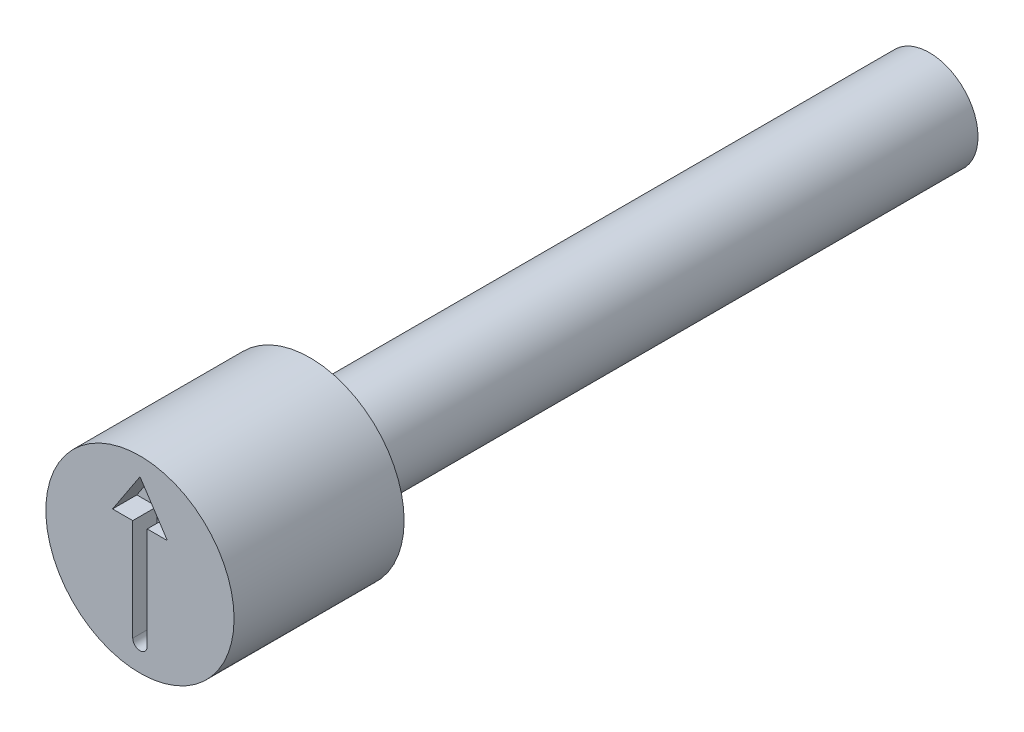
from build123d import *

# Parameters (mm, degrees)
CUT_EXTRUDE4_DEPTH = 0.4


with BuildPart() as part:
    # Sketch2 → Revolve1 (revolve)
    with BuildSketch(Plane(origin=(0, 0, 0), x_dir=(0, 0, -1), z_dir=(1, 0, 0)), mode=Mode.PRIVATE) as revolve1_sk:
        Polygon((0, 1.55), (0, 0), (13, 0), (13, 0.8), (2.8, 0.8), (2.8, 1.55), align=None)
    revolve(revolve1_sk.sketch.rotate(Axis((0, 0, -0.403888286), (0, 0, -1)), 90), axis=Axis((0, 0, -0.403888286), (0, 0, -1)))

    # Sketch3 → Cut-Extrude4 (cut)
    with BuildSketch(Plane.XY):
        with BuildLine():
            Line((0.119045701, 0.566469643), (0.119045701, -1.110101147))
            ThreePointArc((0.119045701, -1.110101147), (0, -1.229146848), (-0.119045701, -1.110101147))
            Line((-0.119045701, -1.110101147), (-0.119045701, 0.566469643))
            Line((-0.119045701, 0.566469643), (-0.451198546, 0.566469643))
            Line((-0.451198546, 0.566469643), (0, 1.251322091))
            Line((0, 1.251322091), (0.451198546, 0.566469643))
            Line((0.451198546, 0.566469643), (0.119045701, 0.566469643))
        make_face()
    extrude(amount=-CUT_EXTRUDE4_DEPTH, mode=Mode.SUBTRACT)


solid = part.part
